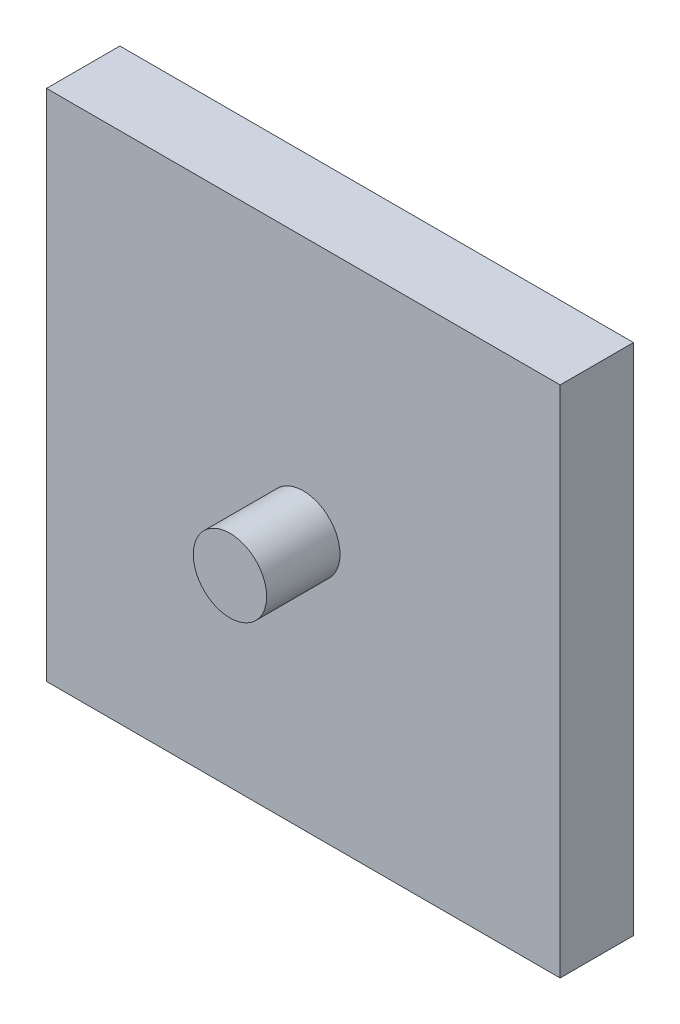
from build123d import *

# Parameters (mm, degrees)
SZKIC1_W                    = 70
SZKIC1_H                    = 70
DODANIE_WYCI_GNI_CIE1_DEPTH = 10
SZKIC2_R                    = 5
DODANIE_WYCI_GNI_CIE2_DEPTH = 10


with BuildPart() as part:
    # Szkic1 → Dodanie-wyci_gni_cie1 (new body)
    with BuildSketch(Plane.XY):
        Rectangle(SZKIC1_W, SZKIC1_H)
    extrude(amount=DODANIE_WYCI_GNI_CIE1_DEPTH)

    # Szkic2 → Dodanie-wyci_gni_cie2 (add)
    with BuildSketch(Plane.XY.offset(10)):
        Circle(SZKIC2_R)
    extrude(amount=DODANIE_WYCI_GNI_CIE2_DEPTH)


solid = part.part
